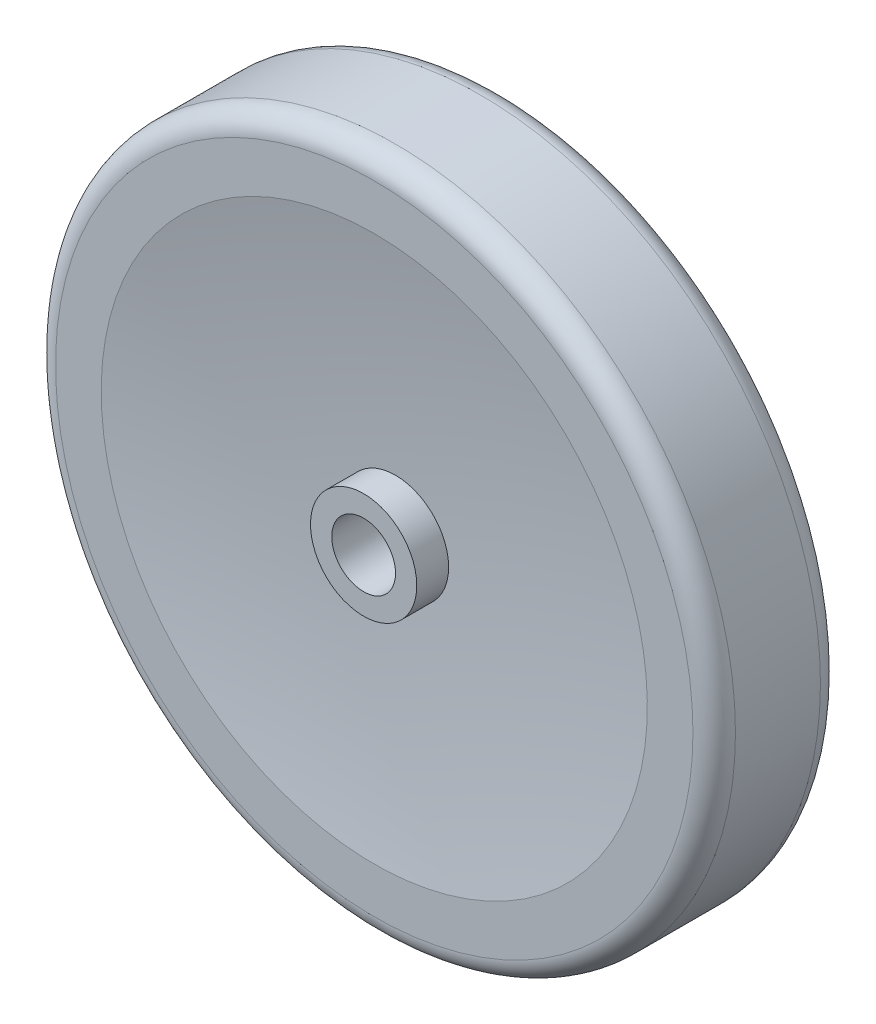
ISO-10303-21;
HEADER;
FILE_DESCRIPTION(('STEP AP214'),'2;1');
FILE_NAME('part.step','',(''),(''),'','','');
FILE_SCHEMA(('AUTOMOTIVE_DESIGN { 1 0 10303 214 1 1 1 1 }'));
ENDSEC;
DATA;
#1=APPLICATION_CONTEXT('core data for automotive mechanical design processes');
#2=APPLICATION_PROTOCOL_DEFINITION('international standard','automotive_design',2000,#1);
#3=PRODUCT_CONTEXT('',#1,'mechanical');
#4=PRODUCT('Part','Part','',(#3));
#5=PRODUCT_RELATED_PRODUCT_CATEGORY('part','',(#4));
#6=PRODUCT_DEFINITION_FORMATION('','',#4);
#7=PRODUCT_DEFINITION_CONTEXT('part definition',#1,'design');
#8=PRODUCT_DEFINITION('design','',#6,#7);
#9=PRODUCT_DEFINITION_SHAPE('','',#8);
#10=(LENGTH_UNIT() NAMED_UNIT(*) SI_UNIT(.MILLI.,.METRE.));
#11=(NAMED_UNIT(*) PLANE_ANGLE_UNIT() SI_UNIT($,.RADIAN.));
#12=(NAMED_UNIT(*) SI_UNIT($,.STERADIAN.) SOLID_ANGLE_UNIT());
#13=UNCERTAINTY_MEASURE_WITH_UNIT(LENGTH_MEASURE(1.E-05),#10,'distance_accuracy_value','');
#14=(GEOMETRIC_REPRESENTATION_CONTEXT(3) GLOBAL_UNCERTAINTY_ASSIGNED_CONTEXT((#13)) GLOBAL_UNIT_ASSIGNED_CONTEXT((#10,
#11,#12)) REPRESENTATION_CONTEXT('',''));
#15=CARTESIAN_POINT('',(0.,0.,0.));
#16=DIRECTION('',(0.,0.,1.));
#17=DIRECTION('',(1.,0.,0.));
#18=AXIS2_PLACEMENT_3D('',#15,#16,#17);
#19=CARTESIAN_POINT('',(0.,1.59337173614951E-13,-260.225946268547));
#20=DIRECTION('',(0.,0.,1.));
#21=DIRECTION('',(0.,1.,0.));
#22=AXIS2_PLACEMENT_3D('',#19,#20,#21);
#23=SPHERICAL_SURFACE('',#22,254.);
#24=CARTESIAN_POINT('',(0.,0.,-9.52500000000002));
#25=DIRECTION('',(0.,0.,1.));
#26=DIRECTION('',(1.,0.,0.));
#27=AXIS2_PLACEMENT_3D('',#24,#25,#26);
#28=CIRCLE('',#27,40.8048470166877);
#29=CARTESIAN_POINT('',(0.,40.804847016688,-9.52500000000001));
#30=VERTEX_POINT('',#29);
#31=EDGE_CURVE('E10',#30,#30,#28,.T.);
#32=CARTESIAN_POINT('',(0.,0.,-6.35000000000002));
#33=DIRECTION('',(0.,0.,1.));
#34=DIRECTION('',(1.,0.,0.));
#35=AXIS2_PLACEMENT_3D('',#32,#33,#34);
#36=CIRCLE('',#35,7.9375);
#37=CARTESIAN_POINT('',(0.,7.93750000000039,-6.34999999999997));
#38=VERTEX_POINT('',#37);
#39=EDGE_CURVE('E93',#38,#38,#36,.T.);
#40=CARTESIAN_POINT('',(0.,40.804847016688,-9.52500000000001));
#41=CARTESIAN_POINT('',(0.,40.4651130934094,-9.46970387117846));
#42=CARTESIAN_POINT('',(0.,40.12526676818,-9.41509832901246));
#43=CARTESIAN_POINT('',(0.,39.4453549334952,-9.30726930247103));
#44=CARTESIAN_POINT('',(0.,39.1052894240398,-9.25404581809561));
#45=CARTESIAN_POINT('',(0.,38.4249448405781,-9.14898179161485));
#46=CARTESIAN_POINT('',(0.,38.0846657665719,-9.09714124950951));
#47=CARTESIAN_POINT('',(0.,37.4038996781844,-8.99484396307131));
#48=CARTESIAN_POINT('',(0.,37.063412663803,-8.94438721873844));
#49=CARTESIAN_POINT('',(0.,36.3822363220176,-8.84485836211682));
#50=CARTESIAN_POINT('',(0.,36.0415469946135,-8.79578624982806));
#51=CARTESIAN_POINT('',(0.,35.3599716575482,-8.69902746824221));
#52=CARTESIAN_POINT('',(0.,35.0190856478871,-8.65134079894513));
#53=CARTESIAN_POINT('',(0.,34.3371225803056,-8.55735369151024));
#54=CARTESIAN_POINT('',(0.,33.9960455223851,-8.51105325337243));
#55=CARTESIAN_POINT('',(0.,33.3137059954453,-8.41983937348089));
#56=CARTESIAN_POINT('',(0.,32.9724435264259,-8.37492593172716));
#57=CARTESIAN_POINT('',(0.,32.2897388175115,-8.28648678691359));
#58=CARTESIAN_POINT('',(0.,31.9482965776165,-8.24296108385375));
#59=CARTESIAN_POINT('',(0.,31.2652379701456,-8.15729813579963));
#60=CARTESIAN_POINT('',(0.,30.9236216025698,-8.11516089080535));
#61=CARTESIAN_POINT('',(0.,30.2402203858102,-8.0322755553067));
#62=CARTESIAN_POINT('',(0.,29.8984355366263,-7.99152746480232));
#63=CARTESIAN_POINT('',(0.,29.2147030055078,-7.91142111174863));
#64=CARTESIAN_POINT('',(0.,28.8727553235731,-7.87206284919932));
#65=CARTESIAN_POINT('',(0.,28.1887027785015,-7.79473680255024));
#66=CARTESIAN_POINT('',(0.,27.8465979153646,-7.75676901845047));
#67=CARTESIAN_POINT('',(0.,27.1622366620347,-7.68222455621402));
#68=CARTESIAN_POINT('',(0.,26.8199802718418,-7.64564787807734));
#69=CARTESIAN_POINT('',(0.,26.1353216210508,-7.57388623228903));
#70=CARTESIAN_POINT('',(0.,25.7929193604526,-7.5387012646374));
#71=CARTESIAN_POINT('',(0.,25.1079746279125,-7.46972362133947));
#72=CARTESIAN_POINT('',(0.,24.7654321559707,-7.43593094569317));
#73=CARTESIAN_POINT('',(0.,24.0802126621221,-7.36973844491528));
#74=CARTESIAN_POINT('',(0.,23.7375356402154,-7.33733861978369));
#75=CARTESIAN_POINT('',(0.,23.05205271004,-7.27393235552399));
#76=CARTESIAN_POINT('',(0.,22.7092468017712,-7.24292591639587));
#77=CARTESIAN_POINT('',(0.,22.0235117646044,-7.18230693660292));
#78=CARTESIAN_POINT('',(0.,21.6805826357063,-7.15269439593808));
#79=CARTESIAN_POINT('',(0.,20.9946068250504,-7.09486370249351));
#80=CARTESIAN_POINT('',(0.,20.6515601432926,-7.06664554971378));
#81=CARTESIAN_POINT('',(0.,19.9653548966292,-7.01160409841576));
#82=CARTESIAN_POINT('',(0.,19.6221963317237,-6.98478079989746));
#83=CARTESIAN_POINT('',(0.,18.9357729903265,-6.93252950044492));
#84=CARTESIAN_POINT('',(0.,18.5925082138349,-6.90710149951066));
#85=CARTESIAN_POINT('',(0.,17.9058781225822,-6.85764121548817));
#86=CARTESIAN_POINT('',(0.,17.5625128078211,-6.83360893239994));
#87=CARTESIAN_POINT('',(0.,16.8756873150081,-6.78694048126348));
#88=CARTESIAN_POINT('',(0.,16.5322271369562,-6.76430431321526));
#89=CARTESIAN_POINT('',(0.,15.8452175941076,-6.7204284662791));
#90=CARTESIAN_POINT('',(0.,15.5016682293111,-6.69918878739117));
#91=CARTESIAN_POINT('',(0.,14.8144859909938,-6.65810626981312));
#92=CARTESIAN_POINT('',(0.,14.470853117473,-6.63826343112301));
#93=CARTESIAN_POINT('',(0.,13.7835095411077,-6.59997492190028));
#94=CARTESIAN_POINT('',(0.,13.4397988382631,-6.58152925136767));
#95=CARTESIAN_POINT('',(0.,12.7523052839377,-6.54603538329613));
#96=CARTESIAN_POINT('',(0.,12.408522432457,-6.5289871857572));
#97=CARTESIAN_POINT('',(0.,11.7208902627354,-6.49628854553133));
#98=CARTESIAN_POINT('',(0.,11.3770409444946,-6.4806381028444));
#99=CARTESIAN_POINT('',(0.,10.689281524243,-6.45073523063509));
#100=CARTESIAN_POINT('',(0.,10.3453714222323,-6.43648280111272));
#101=CARTESIAN_POINT('',(0.,9.65749611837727,-6.4093761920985));
#102=CARTESIAN_POINT('',(0.,9.3135309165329,-6.39652201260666));
#103=CARTESIAN_POINT('',(0.,8.62555109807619,-6.37221211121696));
#104=CARTESIAN_POINT('',(0.,8.28153648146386,-6.3607563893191));
#105=CARTESIAN_POINT('',(0.,7.93750000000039,-6.34999999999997));
#106=B_SPLINE_CURVE_WITH_KNOTS('',3,(#40,#41,#42,#43,#44,#45,#46,#47,#48,#49,#50,#51,#52,#53,
#54,#55,#56,#57,#58,#59,#60,#61,#62,#63,#64,#65,#66,#67,#68,#69,#70,#71,#72,#73,#74,#75,#76,#77,
#78,#79,#80,#81,#82,#83,#84,#85,#86,#87,#88,#89,#90,#91,#92,#93,#94,#95,#96,#97,#98,#99,#100,
#101,#102,#103,#104,#105),.UNSPECIFIED.,.F.,.F.,(4,2,2,2,2,2,2,2,2,2,2,2,2,2,2,2,2,2,2,2,2,2,2,
2,2,2,2,2,2,2,2,2,4),(0.,1.03261306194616,2.06522612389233,3.09783918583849,4.13045224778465,
5.16306530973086,6.19567837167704,7.22829143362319,8.26090449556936,9.29351755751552,
10.3261306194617,11.3587436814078,12.3913567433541,13.4239698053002,14.4565828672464,
15.4891959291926,16.5218089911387,17.5544220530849,18.587035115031,19.6196481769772,
20.6522612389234,21.6848743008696,22.7174873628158,23.7501004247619,24.7827134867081,
25.8153265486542,26.8479396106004,27.8805526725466,28.9131657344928,29.945778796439,
30.9783918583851,32.0110049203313,33.0436179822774),.UNSPECIFIED.);
#107=EDGE_CURVE('BSEAM40',#30,#38,#106,.T.);
#108=ORIENTED_EDGE('',*,*,#31,.F.);
#109=ORIENTED_EDGE('',*,*,#39,.T.);
#110=ORIENTED_EDGE('',*,*,#107,.T.);
#111=ORIENTED_EDGE('',*,*,#107,.F.);
#112=EDGE_LOOP('',(#108,#110,#109,#111));
#113=FACE_BOUND('',#112,.T.);
#114=ADVANCED_FACE('F40',(#113),#23,.F.);
#115=CARTESIAN_POINT('',(0.,47.625,-9.52500000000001));
#116=DIRECTION('',(0.,0.,1.));
#117=DIRECTION('',(1.,0.,0.));
#118=AXIS2_PLACEMENT_3D('',#115,#116,#117);
#119=PLANE('',#118);
#120=CARTESIAN_POINT('',(0.,0.,-9.52500000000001));
#121=DIRECTION('',(0.,0.,1.));
#122=DIRECTION('',(1.,0.,0.));
#123=AXIS2_PLACEMENT_3D('',#120,#121,#122);
#124=CIRCLE('',#123,47.625);
#125=CARTESIAN_POINT('',(47.625,0.,-9.52500000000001));
#126=VERTEX_POINT('',#125);
#127=EDGE_CURVE('E47',#126,#126,#124,.T.);
#128=ORIENTED_EDGE('',*,*,#127,.F.);
#129=EDGE_LOOP('',(#128));
#130=FACE_BOUND('',#129,.T.);
#131=ORIENTED_EDGE('',*,*,#31,.T.);
#132=EDGE_LOOP('',(#131));
#133=FACE_BOUND('',#132,.T.);
#134=ADVANCED_FACE('F156',(#130,#133),#119,.F.);
#135=CARTESIAN_POINT('',(0.,0.,-6.35000000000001));
#136=DIRECTION('',(0.,0.,1.));
#137=DIRECTION('',(1.,0.,0.));
#138=AXIS2_PLACEMENT_3D('',#135,#136,#137);
#139=TOROIDAL_SURFACE('',#138,47.625,3.175);
#140=CARTESIAN_POINT('',(0.,0.,-6.34999999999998));
#141=DIRECTION('',(0.,0.,1.));
#142=DIRECTION('',(1.,0.,0.));
#143=AXIS2_PLACEMENT_3D('',#140,#141,#142);
#144=CIRCLE('',#143,50.8);
#145=CARTESIAN_POINT('',(50.8,0.,-6.34999999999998));
#146=VERTEX_POINT('',#145);
#147=EDGE_CURVE('E53',#146,#146,#144,.T.);
#148=ORIENTED_EDGE('',*,*,#147,.F.);
#149=EDGE_LOOP('',(#148));
#150=FACE_BOUND('',#149,.T.);
#151=ORIENTED_EDGE('',*,*,#127,.T.);
#152=EDGE_LOOP('',(#151));
#153=FACE_BOUND('',#152,.T.);
#154=ADVANCED_FACE('F151',(#150,#153),#139,.T.);
#155=CARTESIAN_POINT('',(0.,0.,26.7185792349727));
#156=DIRECTION('',(0.,0.,1.));
#157=DIRECTION('',(1.,0.,0.));
#158=AXIS2_PLACEMENT_3D('',#155,#156,#157);
#159=CYLINDRICAL_SURFACE('',#158,50.8);
#160=CARTESIAN_POINT('',(0.,0.,6.35));
#161=DIRECTION('',(0.,0.,1.));
#162=DIRECTION('',(1.,0.,0.));
#163=AXIS2_PLACEMENT_3D('',#160,#161,#162);
#164=CIRCLE('',#163,50.8);
#165=CARTESIAN_POINT('',(50.8,0.,6.35));
#166=VERTEX_POINT('',#165);
#167=EDGE_CURVE('E59',#166,#166,#164,.T.);
#168=ORIENTED_EDGE('',*,*,#167,.F.);
#169=EDGE_LOOP('',(#168));
#170=FACE_BOUND('',#169,.T.);
#171=ORIENTED_EDGE('',*,*,#147,.T.);
#172=EDGE_LOOP('',(#171));
#173=FACE_BOUND('',#172,.T.);
#174=ADVANCED_FACE('F145',(#170,#173),#159,.T.);
#175=CARTESIAN_POINT('',(0.,0.,6.35));
#176=DIRECTION('',(0.,0.,1.));
#177=DIRECTION('',(1.,0.,0.));
#178=AXIS2_PLACEMENT_3D('',#175,#176,#177);
#179=TOROIDAL_SURFACE('',#178,47.625,3.175);
#180=CARTESIAN_POINT('',(0.,0.,9.525));
#181=DIRECTION('',(0.,0.,1.));
#182=DIRECTION('',(1.,0.,0.));
#183=AXIS2_PLACEMENT_3D('',#180,#181,#182);
#184=CIRCLE('',#183,47.625);
#185=CARTESIAN_POINT('',(47.625,0.,9.525));
#186=VERTEX_POINT('',#185);
#187=EDGE_CURVE('E65',#186,#186,#184,.T.);
#188=ORIENTED_EDGE('',*,*,#187,.F.);
#189=EDGE_LOOP('',(#188));
#190=FACE_BOUND('',#189,.T.);
#191=ORIENTED_EDGE('',*,*,#167,.T.);
#192=EDGE_LOOP('',(#191));
#193=FACE_BOUND('',#192,.T.);
#194=ADVANCED_FACE('F139',(#190,#193),#179,.T.);
#195=CARTESIAN_POINT('',(0.,47.625,9.525));
#196=DIRECTION('',(0.,0.,-1.));
#197=DIRECTION('',(-1.,0.,0.));
#198=AXIS2_PLACEMENT_3D('',#195,#196,#197);
#199=PLANE('',#198);
#200=CARTESIAN_POINT('',(0.,0.,9.52500000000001));
#201=DIRECTION('',(0.,0.,1.));
#202=DIRECTION('',(1.,0.,0.));
#203=AXIS2_PLACEMENT_3D('',#200,#201,#202);
#204=CIRCLE('',#203,40.8048470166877);
#205=CARTESIAN_POINT('',(0.,40.8048470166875,9.52500000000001));
#206=VERTEX_POINT('',#205);
#207=EDGE_CURVE('E69',#206,#206,#204,.T.);
#208=ORIENTED_EDGE('',*,*,#207,.F.);
#209=EDGE_LOOP('',(#208));
#210=FACE_BOUND('',#209,.T.);
#211=ORIENTED_EDGE('',*,*,#187,.T.);
#212=EDGE_LOOP('',(#211));
#213=FACE_BOUND('',#212,.T.);
#214=ADVANCED_FACE('F133',(#210,#213),#199,.F.);
#215=CARTESIAN_POINT('',(0.,0.,260.225946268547));
#216=DIRECTION('',(0.,0.,1.));
#217=DIRECTION('',(0.,1.,0.));
#218=AXIS2_PLACEMENT_3D('',#215,#216,#217);
#219=SPHERICAL_SURFACE('',#218,254.);
#220=CARTESIAN_POINT('',(0.,0.,6.34999999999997));
#221=DIRECTION('',(0.,0.,1.));
#222=DIRECTION('',(1.,0.,0.));
#223=AXIS2_PLACEMENT_3D('',#220,#221,#222);
#224=CIRCLE('',#223,7.93750000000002);
#225=CARTESIAN_POINT('',(0.,7.93749999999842,6.34999999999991));
#226=VERTEX_POINT('',#225);
#227=EDGE_CURVE('E73',#226,#226,#224,.T.);
#228=CARTESIAN_POINT('',(0.,7.93749999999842,6.34999999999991));
#229=CARTESIAN_POINT('',(0.,8.28153648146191,6.36075638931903));
#230=CARTESIAN_POINT('',(0.,8.62555109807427,6.37221211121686));
#231=CARTESIAN_POINT('',(0.,9.31353091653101,6.39652201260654));
#232=CARTESIAN_POINT('',(0.,9.6574961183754,6.40937619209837));
#233=CARTESIAN_POINT('',(0.,10.3453714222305,6.43648280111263));
#234=CARTESIAN_POINT('',(0.,10.6892815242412,6.45073523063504));
#235=CARTESIAN_POINT('',(0.,11.3770409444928,6.48063810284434));
#236=CARTESIAN_POINT('',(0.,11.7208902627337,6.49628854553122));
#237=CARTESIAN_POINT('',(0.,12.4085224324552,6.52898718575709));
#238=CARTESIAN_POINT('',(0.,12.752305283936,6.54603538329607));
#239=CARTESIAN_POINT('',(0.,13.4397988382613,6.58152925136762));
#240=CARTESIAN_POINT('',(0.,13.783509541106,6.59997492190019));
#241=CARTESIAN_POINT('',(0.,14.4708531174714,6.63826343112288));
#242=CARTESIAN_POINT('',(0.,14.8144859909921,6.65810626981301));
#243=CARTESIAN_POINT('',(0.,15.5016682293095,6.69918878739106));
#244=CARTESIAN_POINT('',(0.,15.8452175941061,6.72042846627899));
#245=CARTESIAN_POINT('',(0.,16.5322271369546,6.76430431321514));
#246=CARTESIAN_POINT('',(0.,16.8756873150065,6.78694048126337));
#247=CARTESIAN_POINT('',(0.,17.5625128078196,6.83360893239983));
#248=CARTESIAN_POINT('',(0.,17.9058781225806,6.85764121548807));
#249=CARTESIAN_POINT('',(0.,18.5925082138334,6.90710149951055));
#250=CARTESIAN_POINT('',(0.,18.9357729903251,6.93252950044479));
#251=CARTESIAN_POINT('',(0.,19.6221963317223,6.98478079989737));
#252=CARTESIAN_POINT('',(0.,19.9653548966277,7.0116040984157));
#253=CARTESIAN_POINT('',(0.,20.6515601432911,7.06664554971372));
#254=CARTESIAN_POINT('',(0.,20.994606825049,7.09486370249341));
#255=CARTESIAN_POINT('',(0.,21.680582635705,7.15269439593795));
#256=CARTESIAN_POINT('',(0.,22.023511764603,7.18230693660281));
#257=CARTESIAN_POINT('',(0.,22.7092468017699,7.24292591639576));
#258=CARTESIAN_POINT('',(0.,23.0520527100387,7.27393235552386));
#259=CARTESIAN_POINT('',(0.,23.7375356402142,7.3373386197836));
#260=CARTESIAN_POINT('',(0.,24.0802126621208,7.36973844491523));
#261=CARTESIAN_POINT('',(0.,24.7654321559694,7.43593094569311));
#262=CARTESIAN_POINT('',(0.,25.1079746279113,7.46972362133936));
#263=CARTESIAN_POINT('',(0.,25.7929193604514,7.53870126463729));
#264=CARTESIAN_POINT('',(0.,26.1353216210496,7.57388623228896));
#265=CARTESIAN_POINT('',(0.,26.8199802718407,7.64564787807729));
#266=CARTESIAN_POINT('',(0.,27.1622366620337,7.68222455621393));
#267=CARTESIAN_POINT('',(0.,27.8465979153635,7.75676901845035));
#268=CARTESIAN_POINT('',(0.,28.1887027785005,7.79473680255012));
#269=CARTESIAN_POINT('',(0.,28.8727553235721,7.87206284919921));
#270=CARTESIAN_POINT('',(0.,29.2147030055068,7.91142111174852));
#271=CARTESIAN_POINT('',(0.,29.8984355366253,7.99152746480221));
#272=CARTESIAN_POINT('',(0.,30.2402203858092,8.03227555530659));
#273=CARTESIAN_POINT('',(0.,30.9236216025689,8.11516089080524));
#274=CARTESIAN_POINT('',(0.,31.2652379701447,8.15729813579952));
#275=CARTESIAN_POINT('',(0.,31.9482965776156,8.24296108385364));
#276=CARTESIAN_POINT('',(0.,32.2897388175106,8.28648678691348));
#277=CARTESIAN_POINT('',(0.,32.9724435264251,8.37492593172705));
#278=CARTESIAN_POINT('',(0.,33.3137059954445,8.41983937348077));
#279=CARTESIAN_POINT('',(0.,33.9960455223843,8.51105325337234));
#280=CARTESIAN_POINT('',(0.,34.3371225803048,8.55735369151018));
#281=CARTESIAN_POINT('',(0.,35.0190856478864,8.65134079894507));
#282=CARTESIAN_POINT('',(0.,35.3599716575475,8.69902746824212));
#283=CARTESIAN_POINT('',(0.,36.0415469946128,8.79578624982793));
#284=CARTESIAN_POINT('',(0.,36.3822363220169,8.84485836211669));
#285=CARTESIAN_POINT('',(0.,37.0634126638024,8.94438721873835));
#286=CARTESIAN_POINT('',(0.,37.4038996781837,8.99484396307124));
#287=CARTESIAN_POINT('',(0.,38.0846657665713,9.09714124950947));
#288=CARTESIAN_POINT('',(0.,38.4249448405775,9.1489817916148));
#289=CARTESIAN_POINT('',(0.,39.1052894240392,9.25404581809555));
#290=CARTESIAN_POINT('',(0.,39.4453549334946,9.30726930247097));
#291=CARTESIAN_POINT('',(0.,40.1252667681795,9.41509832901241));
#292=CARTESIAN_POINT('',(0.,40.4651130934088,9.46970387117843));
#293=CARTESIAN_POINT('',(0.,40.8048470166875,9.52500000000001));
#294=B_SPLINE_CURVE_WITH_KNOTS('',3,(#228,#229,#230,#231,#232,#233,#234,#235,#236,#237,#238,
#239,#240,#241,#242,#243,#244,#245,#246,#247,#248,#249,#250,#251,#252,#253,#254,#255,#256,#257,
#258,#259,#260,#261,#262,#263,#264,#265,#266,#267,#268,#269,#270,#271,#272,#273,#274,#275,#276,
#277,#278,#279,#280,#281,#282,#283,#284,#285,#286,#287,#288,#289,#290,#291,#292,#293),
.UNSPECIFIED.,.F.,.F.,(4,2,2,2,2,2,2,2,2,2,2,2,2,2,2,2,2,2,2,2,2,2,2,2,2,2,2,2,2,2,2,2,4),(0.,
1.03261306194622,2.06522612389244,3.09783918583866,4.13045224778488,5.1630653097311,
6.19567837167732,7.22829143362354,8.26090449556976,9.29351755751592,10.3261306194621,
11.3587436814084,12.3913567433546,13.4239698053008,14.456582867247,15.4891959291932,
16.5218089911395,17.5544220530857,18.5870351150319,19.6196481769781,20.6522612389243,
21.6848743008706,22.7174873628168,23.750100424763,24.7827134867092,25.8153265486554,
26.8479396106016,27.8805526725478,28.913165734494,29.9457787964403,30.9783918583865,
32.0110049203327,33.0436179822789),.UNSPECIFIED.);
#295=EDGE_CURVE('BSEAM127',#226,#206,#294,.T.);
#296=ORIENTED_EDGE('',*,*,#227,.F.);
#297=ORIENTED_EDGE('',*,*,#207,.T.);
#298=ORIENTED_EDGE('',*,*,#295,.T.);
#299=ORIENTED_EDGE('',*,*,#295,.F.);
#300=EDGE_LOOP('',(#296,#298,#297,#299));
#301=FACE_BOUND('',#300,.T.);
#302=ADVANCED_FACE('F127',(#301),#219,.F.);
#303=CARTESIAN_POINT('',(0.,0.,26.7185792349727));
#304=DIRECTION('',(0.,0.,1.));
#305=DIRECTION('',(1.,0.,0.));
#306=AXIS2_PLACEMENT_3D('',#303,#304,#305);
#307=CYLINDRICAL_SURFACE('',#306,7.93750000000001);
#308=CARTESIAN_POINT('',(0.,0.,11.1125));
#309=DIRECTION('',(0.,0.,1.));
#310=DIRECTION('',(1.,0.,0.));
#311=AXIS2_PLACEMENT_3D('',#308,#309,#310);
#312=CIRCLE('',#311,7.9375);
#313=CARTESIAN_POINT('',(7.9375,0.,11.1125));
#314=VERTEX_POINT('',#313);
#315=EDGE_CURVE('E77',#314,#314,#312,.T.);
#316=ORIENTED_EDGE('',*,*,#315,.F.);
#317=EDGE_LOOP('',(#316));
#318=FACE_BOUND('',#317,.T.);
#319=ORIENTED_EDGE('',*,*,#227,.T.);
#320=EDGE_LOOP('',(#319));
#321=FACE_BOUND('',#320,.T.);
#322=ADVANCED_FACE('F121',(#318,#321),#307,.T.);
#323=CARTESIAN_POINT('',(0.,4.7625,11.1125));
#324=DIRECTION('',(0.,0.,-1.));
#325=DIRECTION('',(-1.,0.,0.));
#326=AXIS2_PLACEMENT_3D('',#323,#324,#325);
#327=PLANE('',#326);
#328=CARTESIAN_POINT('',(0.,0.,11.1125));
#329=DIRECTION('',(0.,0.,1.));
#330=DIRECTION('',(1.,0.,0.));
#331=AXIS2_PLACEMENT_3D('',#328,#329,#330);
#332=CIRCLE('',#331,4.7625);
#333=CARTESIAN_POINT('',(4.7625,0.,11.1125));
#334=VERTEX_POINT('',#333);
#335=EDGE_CURVE('E81',#334,#334,#332,.T.);
#336=ORIENTED_EDGE('',*,*,#335,.F.);
#337=EDGE_LOOP('',(#336));
#338=FACE_BOUND('',#337,.T.);
#339=ORIENTED_EDGE('',*,*,#315,.T.);
#340=EDGE_LOOP('',(#339));
#341=FACE_BOUND('',#340,.T.);
#342=ADVANCED_FACE('F115',(#338,#341),#327,.F.);
#343=CARTESIAN_POINT('',(0.,0.,26.7185792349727));
#344=DIRECTION('',(0.,0.,1.));
#345=DIRECTION('',(1.,0.,0.));
#346=AXIS2_PLACEMENT_3D('',#343,#344,#345);
#347=CYLINDRICAL_SURFACE('',#346,4.7625);
#348=CARTESIAN_POINT('',(0.,0.,-11.1125));
#349=DIRECTION('',(0.,0.,1.));
#350=DIRECTION('',(1.,0.,0.));
#351=AXIS2_PLACEMENT_3D('',#348,#349,#350);
#352=CIRCLE('',#351,4.7625);
#353=CARTESIAN_POINT('',(4.7625,0.,-11.1125));
#354=VERTEX_POINT('',#353);
#355=EDGE_CURVE('E85',#354,#354,#352,.T.);
#356=ORIENTED_EDGE('',*,*,#355,.F.);
#357=EDGE_LOOP('',(#356));
#358=FACE_BOUND('',#357,.T.);
#359=ORIENTED_EDGE('',*,*,#335,.T.);
#360=EDGE_LOOP('',(#359));
#361=FACE_BOUND('',#360,.T.);
#362=ADVANCED_FACE('F109',(#358,#361),#347,.F.);
#363=CARTESIAN_POINT('',(0.,4.7625,-11.1125));
#364=DIRECTION('',(0.,0.,1.));
#365=DIRECTION('',(1.,0.,0.));
#366=AXIS2_PLACEMENT_3D('',#363,#364,#365);
#367=PLANE('',#366);
#368=CARTESIAN_POINT('',(0.,0.,-11.1125));
#369=DIRECTION('',(0.,0.,1.));
#370=DIRECTION('',(1.,0.,0.));
#371=AXIS2_PLACEMENT_3D('',#368,#369,#370);
#372=CIRCLE('',#371,7.9375);
#373=CARTESIAN_POINT('',(7.9375,0.,-11.1125));
#374=VERTEX_POINT('',#373);
#375=EDGE_CURVE('E89',#374,#374,#372,.T.);
#376=ORIENTED_EDGE('',*,*,#375,.F.);
#377=EDGE_LOOP('',(#376));
#378=FACE_BOUND('',#377,.T.);
#379=ORIENTED_EDGE('',*,*,#355,.T.);
#380=EDGE_LOOP('',(#379));
#381=FACE_BOUND('',#380,.T.);
#382=ADVANCED_FACE('F103',(#378,#381),#367,.F.);
#383=CARTESIAN_POINT('',(0.,0.,26.7185792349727));
#384=DIRECTION('',(0.,0.,1.));
#385=DIRECTION('',(1.,0.,0.));
#386=AXIS2_PLACEMENT_3D('',#383,#384,#385);
#387=CYLINDRICAL_SURFACE('',#386,7.9375);
#388=ORIENTED_EDGE('',*,*,#39,.F.);
#389=EDGE_LOOP('',(#388));
#390=FACE_BOUND('',#389,.T.);
#391=ORIENTED_EDGE('',*,*,#375,.T.);
#392=EDGE_LOOP('',(#391));
#393=FACE_BOUND('',#392,.T.);
#394=ADVANCED_FACE('F100',(#390,#393),#387,.T.);
#395=CLOSED_SHELL('',(#114,#134,#154,#174,#194,#214,#302,#322,#342,#362,#382,#394));
#396=MANIFOLD_SOLID_BREP('B2',#395);
#397=ADVANCED_BREP_SHAPE_REPRESENTATION('',(#18,#396),#14);
#398=SHAPE_DEFINITION_REPRESENTATION(#9,#397);
ENDSEC;
END-ISO-10303-21;
